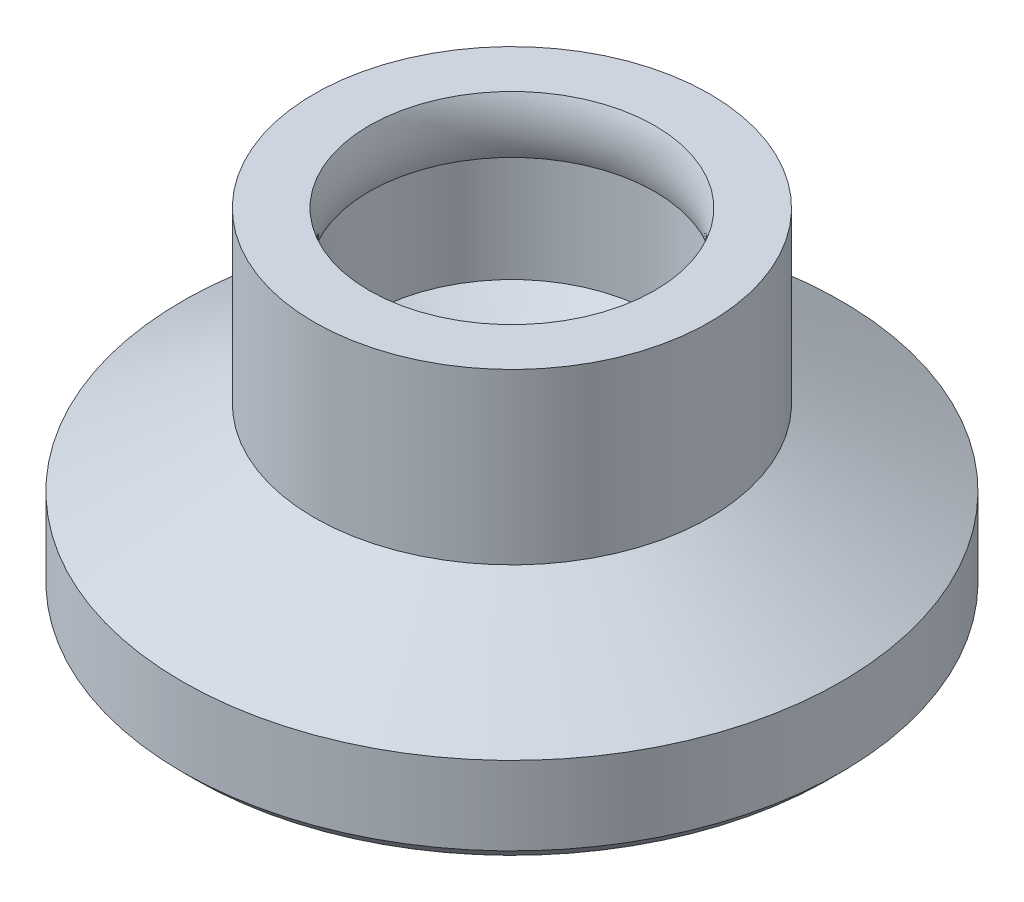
ISO-10303-21;
HEADER;
FILE_DESCRIPTION(('STEP AP214'),'2;1');
FILE_NAME('part.step','',(''),(''),'','','');
FILE_SCHEMA(('AUTOMOTIVE_DESIGN { 1 0 10303 214 1 1 1 1 }'));
ENDSEC;
DATA;
#1=APPLICATION_CONTEXT('core data for automotive mechanical design processes');
#2=APPLICATION_PROTOCOL_DEFINITION('international standard','automotive_design',2000,#1);
#3=PRODUCT_CONTEXT('',#1,'mechanical');
#4=PRODUCT('Part','Part','',(#3));
#5=PRODUCT_RELATED_PRODUCT_CATEGORY('part','',(#4));
#6=PRODUCT_DEFINITION_FORMATION('','',#4);
#7=PRODUCT_DEFINITION_CONTEXT('part definition',#1,'design');
#8=PRODUCT_DEFINITION('design','',#6,#7);
#9=PRODUCT_DEFINITION_SHAPE('','',#8);
#10=(LENGTH_UNIT() NAMED_UNIT(*) SI_UNIT(.MILLI.,.METRE.));
#11=(NAMED_UNIT(*) PLANE_ANGLE_UNIT() SI_UNIT($,.RADIAN.));
#12=(NAMED_UNIT(*) SI_UNIT($,.STERADIAN.) SOLID_ANGLE_UNIT());
#13=UNCERTAINTY_MEASURE_WITH_UNIT(LENGTH_MEASURE(1.E-05),#10,'distance_accuracy_value','');
#14=(GEOMETRIC_REPRESENTATION_CONTEXT(3) GLOBAL_UNCERTAINTY_ASSIGNED_CONTEXT((#13)) GLOBAL_UNIT_ASSIGNED_CONTEXT((#10,
#11,#12)) REPRESENTATION_CONTEXT('',''));
#15=CARTESIAN_POINT('',(0.,0.,0.));
#16=DIRECTION('',(0.,0.,1.));
#17=DIRECTION('',(1.,0.,0.));
#18=AXIS2_PLACEMENT_3D('',#15,#16,#17);
#19=CARTESIAN_POINT('',(0.,4.6,0.));
#20=DIRECTION('',(0.,-1.,0.));
#21=DIRECTION('',(0.,0.,-1.));
#22=AXIS2_PLACEMENT_3D('',#19,#20,#21);
#23=CYLINDRICAL_SURFACE('',#22,5.4);
#24=CARTESIAN_POINT('',(0.,-0.0215390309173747,0.));
#25=DIRECTION('',(0.,1.,0.));
#26=DIRECTION('',(0.,0.,1.));
#27=AXIS2_PLACEMENT_3D('',#24,#25,#26);
#28=CIRCLE('',#27,5.4);
#29=CARTESIAN_POINT('',(0.,-0.0215390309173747,5.4));
#30=VERTEX_POINT('',#29);
#31=EDGE_CURVE('E91',#30,#30,#28,.T.);
#32=ORIENTED_EDGE('',*,*,#31,.T.);
#33=EDGE_LOOP('',(#32));
#34=FACE_BOUND('',#33,.T.);
#35=CARTESIAN_POINT('',(0.,4.6,0.));
#36=DIRECTION('',(0.,1.,0.));
#37=DIRECTION('',(0.,0.,1.));
#38=AXIS2_PLACEMENT_3D('',#35,#36,#37);
#39=CIRCLE('',#38,5.4);
#40=CARTESIAN_POINT('',(0.,4.6,5.4));
#41=VERTEX_POINT('',#40);
#42=EDGE_CURVE('E93',#41,#41,#39,.T.);
#43=ORIENTED_EDGE('',*,*,#42,.F.);
#44=EDGE_LOOP('',(#43));
#45=FACE_BOUND('',#44,.T.);
#46=ADVANCED_FACE('F37',(#34,#45),#23,.T.);
#47=CARTESIAN_POINT('',(0.,4.6,0.));
#48=DIRECTION('',(0.,1.,0.));
#49=DIRECTION('',(0.,0.,1.));
#50=AXIS2_PLACEMENT_3D('',#47,#48,#49);
#51=PLANE('',#50);
#52=CARTESIAN_POINT('',(0.,4.6,0.));
#53=DIRECTION('',(0.,-1.,0.));
#54=DIRECTION('',(0.,0.,-1.));
#55=AXIS2_PLACEMENT_3D('',#52,#53,#54);
#56=CIRCLE('',#55,3.9);
#57=CARTESIAN_POINT('',(0.,4.6,-3.9));
#58=VERTEX_POINT('',#57);
#59=EDGE_CURVE('E110',#58,#58,#56,.T.);
#60=ORIENTED_EDGE('',*,*,#59,.T.);
#61=EDGE_LOOP('',(#60));
#62=FACE_BOUND('',#61,.T.);
#63=ORIENTED_EDGE('',*,*,#42,.T.);
#64=EDGE_LOOP('',(#63));
#65=FACE_BOUND('',#64,.T.);
#66=ADVANCED_FACE('F65',(#62,#65),#51,.T.);
#67=CARTESIAN_POINT('',(0.,-0.0215390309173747,0.));
#68=DIRECTION('',(0.,-1.,0.));
#69=DIRECTION('',(0.,0.,-1.));
#70=AXIS2_PLACEMENT_3D('',#67,#68,#69);
#71=CONICAL_SURFACE('',#70,5.4,1.0471975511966);
#72=CARTESIAN_POINT('',(0.,-2.1,0.));
#73=DIRECTION('',(0.,1.,0.));
#74=DIRECTION('',(0.,0.,1.));
#75=AXIS2_PLACEMENT_3D('',#72,#73,#74);
#76=CIRCLE('',#75,9.);
#77=CARTESIAN_POINT('',(0.,-2.1,9.));
#78=VERTEX_POINT('',#77);
#79=EDGE_CURVE('E89',#78,#78,#76,.T.);
#80=ORIENTED_EDGE('',*,*,#79,.T.);
#81=EDGE_LOOP('',(#80));
#82=FACE_BOUND('',#81,.T.);
#83=ORIENTED_EDGE('',*,*,#31,.F.);
#84=EDGE_LOOP('',(#83));
#85=FACE_BOUND('',#84,.T.);
#86=ADVANCED_FACE('F70',(#82,#85),#71,.T.);
#87=CARTESIAN_POINT('',(0.,-4.6,0.));
#88=DIRECTION('',(0.,1.,0.));
#89=DIRECTION('',(0.,0.,1.));
#90=AXIS2_PLACEMENT_3D('',#87,#88,#89);
#91=PLANE('',#90);
#92=CARTESIAN_POINT('',(0.,-4.6,0.));
#93=DIRECTION('',(0.,1.,0.));
#94=DIRECTION('',(0.,0.,1.));
#95=AXIS2_PLACEMENT_3D('',#92,#93,#94);
#96=CIRCLE('',#95,8.64);
#97=CARTESIAN_POINT('',(0.,-4.6,8.64));
#98=VERTEX_POINT('',#97);
#99=EDGE_CURVE('E45',#98,#98,#96,.F.);
#100=ORIENTED_EDGE('',*,*,#99,.T.);
#101=EDGE_LOOP('',(#100));
#102=FACE_BOUND('',#101,.T.);
#103=ADVANCED_FACE('F76',(#102),#91,.F.);
#104=CARTESIAN_POINT('',(0.,-2.1,0.));
#105=DIRECTION('',(0.,-1.,0.));
#106=DIRECTION('',(0.,0.,-1.));
#107=AXIS2_PLACEMENT_3D('',#104,#105,#106);
#108=CYLINDRICAL_SURFACE('',#107,9.);
#109=CARTESIAN_POINT('',(0.,-4.23999999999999,0.));
#110=DIRECTION('',(0.,1.,0.));
#111=DIRECTION('',(0.,0.,1.));
#112=AXIS2_PLACEMENT_3D('',#109,#110,#111);
#113=CIRCLE('',#112,9.);
#114=CARTESIAN_POINT('',(0.,-4.23999999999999,9.));
#115=VERTEX_POINT('',#114);
#116=EDGE_CURVE('E11',#115,#115,#113,.T.);
#117=ORIENTED_EDGE('',*,*,#116,.T.);
#118=EDGE_LOOP('',(#117));
#119=FACE_BOUND('',#118,.T.);
#120=ORIENTED_EDGE('',*,*,#79,.F.);
#121=EDGE_LOOP('',(#120));
#122=FACE_BOUND('',#121,.T.);
#123=ADVANCED_FACE('F60',(#119,#122),#108,.T.);
#124=CARTESIAN_POINT('',(0.,-4.6,0.));
#125=DIRECTION('',(0.,1.,0.));
#126=DIRECTION('',(0.,0.,1.));
#127=AXIS2_PLACEMENT_3D('',#124,#125,#126);
#128=CONICAL_SURFACE('',#127,8.64,0.785398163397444);
#129=ORIENTED_EDGE('',*,*,#116,.F.);
#130=EDGE_LOOP('',(#129));
#131=FACE_BOUND('',#130,.T.);
#132=ORIENTED_EDGE('',*,*,#99,.F.);
#133=EDGE_LOOP('',(#132));
#134=FACE_BOUND('',#133,.T.);
#135=ADVANCED_FACE('F39',(#131,#134),#128,.T.);
#136=CARTESIAN_POINT('',(0.,-2.1,0.));
#137=DIRECTION('',(0.,1.,0.));
#138=DIRECTION('',(0.,0.,1.));
#139=AXIS2_PLACEMENT_3D('',#136,#137,#138);
#140=CONICAL_SURFACE('',#139,0.,1.04719755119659);
#141=CARTESIAN_POINT('',(0.,0.151666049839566,0.));
#142=DIRECTION('',(0.,-1.,0.));
#143=DIRECTION('',(0.,0.,-1.));
#144=AXIS2_PLACEMENT_3D('',#141,#142,#143);
#145=CIRCLE('',#144,3.9);
#146=CARTESIAN_POINT('',(0.,0.151666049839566,-3.9));
#147=VERTEX_POINT('',#146);
#148=EDGE_CURVE('E101',#147,#147,#145,.T.);
#149=ORIENTED_EDGE('',*,*,#148,.F.);
#150=EDGE_LOOP('',(#149));
#151=FACE_BOUND('',#150,.T.);
#152=CARTESIAN_POINT('',(0.,-2.1,0.));
#153=VERTEX_POINT('',#152);
#154=VERTEX_LOOP('',#153);
#155=FACE_BOUND('',#154,.T.);
#156=ADVANCED_FACE('F48',(#151,#155),#140,.F.);
#157=CARTESIAN_POINT('',(0.,0.,0.));
#158=DIRECTION('',(0.,-1.,0.));
#159=DIRECTION('',(0.,0.,-1.));
#160=AXIS2_PLACEMENT_3D('',#157,#158,#159);
#161=CYLINDRICAL_SURFACE('',#160,3.9);
#162=CARTESIAN_POINT('',(0.,3.04,0.));
#163=DIRECTION('',(0.,-1.,0.));
#164=DIRECTION('',(0.,0.,-1.));
#165=AXIS2_PLACEMENT_3D('',#162,#163,#164);
#166=CIRCLE('',#165,3.9);
#167=CARTESIAN_POINT('',(0.,3.04,-3.9));
#168=VERTEX_POINT('',#167);
#169=EDGE_CURVE('E109',#168,#168,#166,.T.);
#170=ORIENTED_EDGE('',*,*,#169,.F.);
#171=EDGE_LOOP('',(#170));
#172=FACE_BOUND('',#171,.T.);
#173=ORIENTED_EDGE('',*,*,#148,.T.);
#174=EDGE_LOOP('',(#173));
#175=FACE_BOUND('',#174,.T.);
#176=ADVANCED_FACE('F50',(#172,#175),#161,.F.);
#177=CARTESIAN_POINT('',(0.,3.82,0.));
#178=DIRECTION('',(0.,-1.,0.));
#179=DIRECTION('',(0.,0.,-1.));
#180=AXIS2_PLACEMENT_3D('',#177,#178,#179);
#181=TOROIDAL_SURFACE('',#180,5.772,2.028);
#182=ORIENTED_EDGE('',*,*,#59,.F.);
#183=EDGE_LOOP('',(#182));
#184=FACE_BOUND('',#183,.T.);
#185=ORIENTED_EDGE('',*,*,#169,.T.);
#186=EDGE_LOOP('',(#185));
#187=FACE_BOUND('',#186,.T.);
#188=ADVANCED_FACE('F57',(#184,#187),#181,.T.);
#189=CLOSED_SHELL('',(#46,#66,#86,#103,#123,#135,#156,#176,#188));
#190=MANIFOLD_SOLID_BREP('B2',#189);
#191=ADVANCED_BREP_SHAPE_REPRESENTATION('',(#18,#190),#14);
#192=SHAPE_DEFINITION_REPRESENTATION(#9,#191);
ENDSEC;
END-ISO-10303-21;
